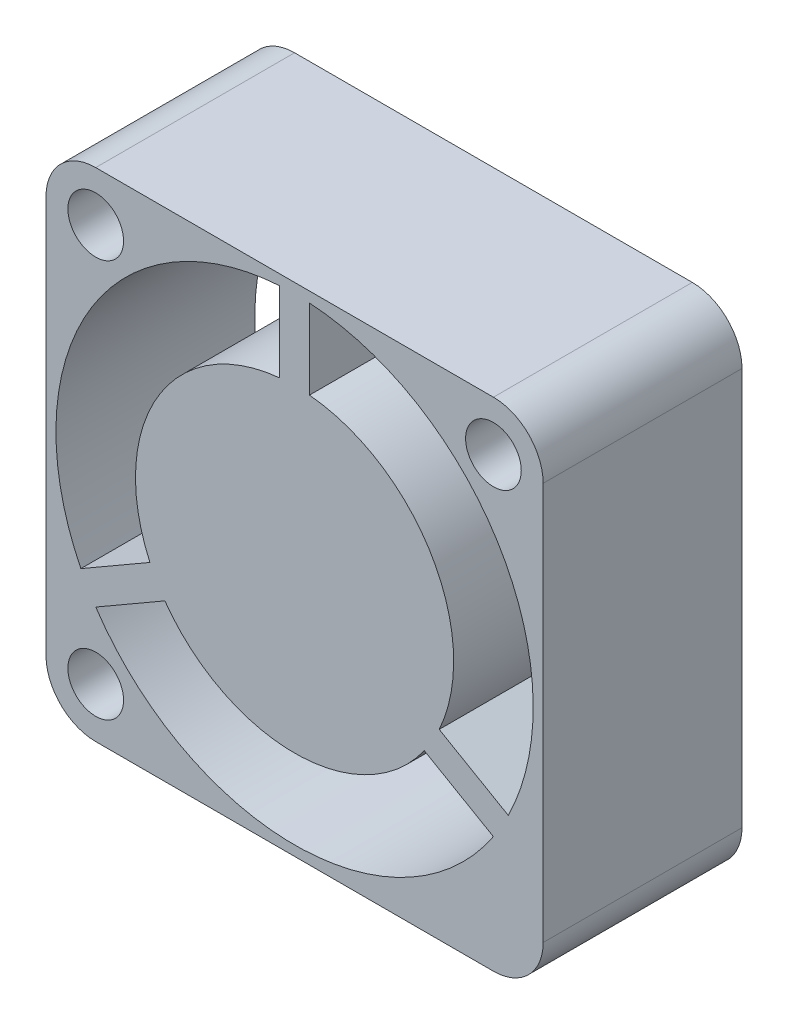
from build123d import *

# Parameters (mm, degrees)
SKETCH1_W           = 25
SKETCH1_H           = 25
SKETCH1_R           = 12
SKETCH1_R_2         = 1.4
BOSS_EXTRUDE1_DEPTH = 10
FILLET1_R           = 2.5
SKETCH2_R           = 8
BOSS_EXTRUDE2_DEPTH = 10
SKETCH3_W           = 1.5
SKETCH3_H           = 4.535233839
BOSS_EXTRUDE3_DEPTH = 10


with BuildPart() as part:
    # Sketch1 → Boss-Extrude1 (new body)
    with BuildSketch(Plane.XY):
        with Locations((12.5, 12.5)):
            Rectangle(SKETCH1_W, SKETCH1_H)
        with Locations((12.5, 12.5)):
            Circle(SKETCH1_R, mode=Mode.SUBTRACT)
        with Locations((2.5, 22.5)):
            Circle(SKETCH1_R_2, mode=Mode.SUBTRACT)
        with Locations((2.5, 2.5)):
            Circle(SKETCH1_R_2, mode=Mode.SUBTRACT)
        with Locations((22.5, 22.5)):
            Circle(SKETCH1_R_2, mode=Mode.SUBTRACT)
    extrude(amount=BOSS_EXTRUDE1_DEPTH)

    # Fillet1
    fillet1_edges = [part.edges().sort_by_distance(p)[0] for p in [
        (0, 25, 5),
        (25, 25, 5),
        (25, 0, 5),
        (0, 0, 5),
    ]]
    fillet(fillet1_edges, radius=FILLET1_R)



with BuildPart() as body_2:
    # Sketch2 → Boss-Extrude2 (new body)
    with BuildSketch(Plane.XY.offset(10)):
        with Locations((12.5, 12.5)):
            Circle(SKETCH2_R)
    extrude(amount=-BOSS_EXTRUDE2_DEPTH)


with BuildPart() as part_1:
    add(part.part)

    add(body_2.part)  # Boss-Extrude3 merges body 2
    # Sketch3 → Boss-Extrude3 (add)
    with BuildSketch(Plane.XY.offset(10)):
        with Locations((12.5, 22.732383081)):
            Rectangle(SKETCH3_W, SKETCH3_H)
        Polygon((23.700317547, 6.899519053), (22.950317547, 5.600480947), (19.022689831, 7.868097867), (19.772689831, 9.167135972), align=None)
        Polygon((2.049682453, 5.600480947), (1.299682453, 6.899519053), (5.227310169, 9.167135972), (5.977310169, 7.868097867), align=None)
    extrude(amount=-BOSS_EXTRUDE3_DEPTH)


solid = part_1.part
